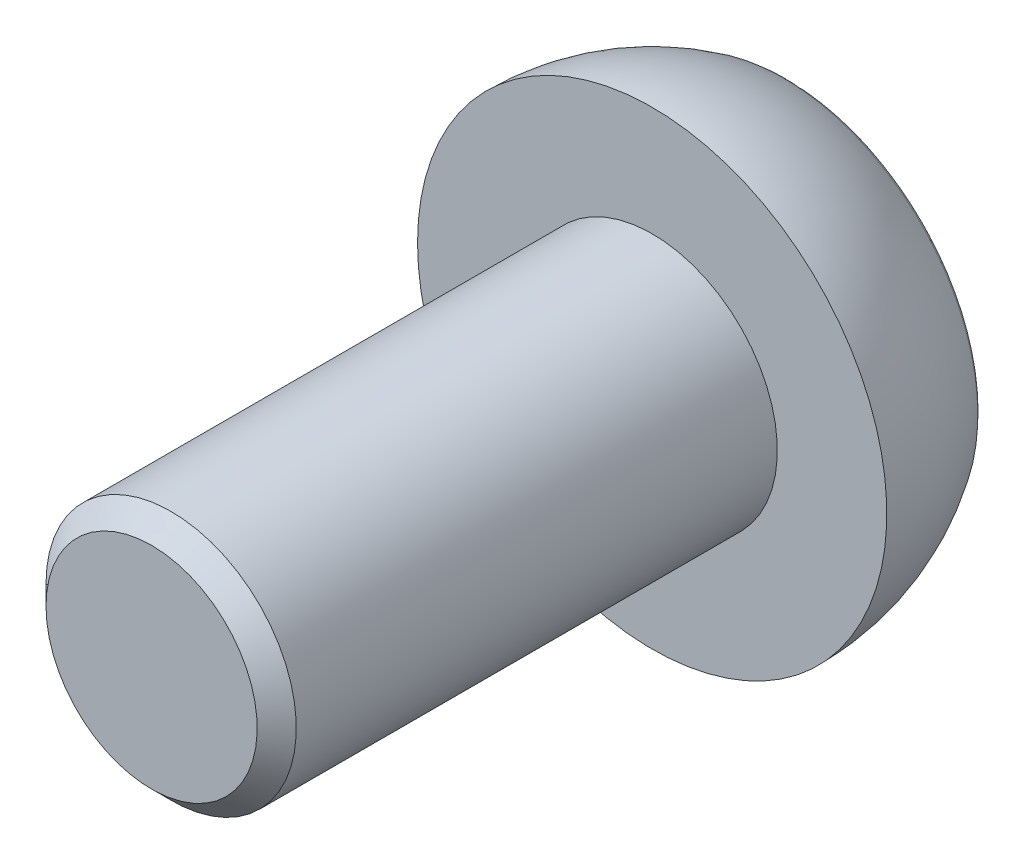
ISO-10303-21;
HEADER;
FILE_DESCRIPTION(('STEP AP214'),'2;1');
FILE_NAME('part.step','',(''),(''),'','','');
FILE_SCHEMA(('AUTOMOTIVE_DESIGN { 1 0 10303 214 1 1 1 1 }'));
ENDSEC;
DATA;
#1=APPLICATION_CONTEXT('core data for automotive mechanical design processes');
#2=APPLICATION_PROTOCOL_DEFINITION('international standard','automotive_design',2000,#1);
#3=PRODUCT_CONTEXT('',#1,'mechanical');
#4=PRODUCT('Part','Part','',(#3));
#5=PRODUCT_RELATED_PRODUCT_CATEGORY('part','',(#4));
#6=PRODUCT_DEFINITION_FORMATION('','',#4);
#7=PRODUCT_DEFINITION_CONTEXT('part definition',#1,'design');
#8=PRODUCT_DEFINITION('design','',#6,#7);
#9=PRODUCT_DEFINITION_SHAPE('','',#8);
#10=(LENGTH_UNIT() NAMED_UNIT(*) SI_UNIT(.MILLI.,.METRE.));
#11=(NAMED_UNIT(*) PLANE_ANGLE_UNIT() SI_UNIT($,.RADIAN.));
#12=(NAMED_UNIT(*) SI_UNIT($,.STERADIAN.) SOLID_ANGLE_UNIT());
#13=UNCERTAINTY_MEASURE_WITH_UNIT(LENGTH_MEASURE(1.E-05),#10,'distance_accuracy_value','');
#14=(GEOMETRIC_REPRESENTATION_CONTEXT(3) GLOBAL_UNCERTAINTY_ASSIGNED_CONTEXT((#13)) GLOBAL_UNIT_ASSIGNED_CONTEXT((#10,
#11,#12)) REPRESENTATION_CONTEXT('',''));
#15=CARTESIAN_POINT('',(0.,0.,0.));
#16=DIRECTION('',(0.,0.,1.));
#17=DIRECTION('',(1.,0.,0.));
#18=AXIS2_PLACEMENT_3D('',#15,#16,#17);
#19=CARTESIAN_POINT('',(65.7291428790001,215.039383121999,-35.5000000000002));
#20=DIRECTION('',(0.,0.,-0.999999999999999));
#21=DIRECTION('',(-0.99997700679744,-0.00678128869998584,0.));
#22=AXIS2_PLACEMENT_3D('',#19,#20,#21);
#23=PLANE('',#22);
#24=DIRECTION('',(-0.494115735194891,-0.869396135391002,0.));
#25=VECTOR('',#24,1.);
#26=CARTESIAN_POINT('',(64.4644896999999,217.195920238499,-35.5000000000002));
#27=LINE('',#26,#25);
#28=CARTESIAN_POINT('',(65.6997790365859,219.36941057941,-35.5000000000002));
#29=VERTEX_POINT('',#28);
#30=CARTESIAN_POINT('',(63.2292003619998,215.022429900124,-35.5000000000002));
#31=VERTEX_POINT('',#30);
#32=EDGE_CURVE('E137',#29,#31,#27,.T.);
#33=ORIENTED_EDGE('',*,*,#32,.T.);
#34=DIRECTION('',(-0.999977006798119,-0.00678128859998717,0.));
#35=VECTOR('',#34,1.);
#36=CARTESIAN_POINT('',(60.7292578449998,215.005476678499,-35.5000000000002));
#37=LINE('',#36,#35);
#38=CARTESIAN_POINT('',(58.229315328,214.988523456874,-35.5000000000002));
#39=VERTEX_POINT('',#38);
#40=EDGE_CURVE('E111',#31,#39,#37,.T.);
#41=ORIENTED_EDGE('',*,*,#40,.T.);
#42=DIRECTION('',(-0.505861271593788,0.862614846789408,0.));
#43=VECTOR('',#42,1.);
#44=CARTESIAN_POINT('',(56.9646621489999,217.145060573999,-35.5000000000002));
#45=LINE('',#44,#43);
#46=CARTESIAN_POINT('',(55.7000089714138,219.301597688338,-35.5000000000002));
#47=VERTEX_POINT('',#46);
#48=EDGE_CURVE('E107',#39,#47,#45,.T.);
#49=ORIENTED_EDGE('',*,*,#48,.T.);
#50=DIRECTION('',(0.49411573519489,0.869396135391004,0.));
#51=VECTOR('',#50,1.);
#52=CARTESIAN_POINT('',(56.9352983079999,221.475088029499,-35.5000000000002));
#53=LINE('',#52,#51);
#54=CARTESIAN_POINT('',(58.1705876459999,223.648578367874,-35.5000000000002));
#55=VERTEX_POINT('',#54);
#56=EDGE_CURVE('E109',#47,#55,#53,.T.);
#57=ORIENTED_EDGE('',*,*,#56,.T.);
#58=DIRECTION('',(0.999977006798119,0.00678128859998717,0.));
#59=VECTOR('',#58,1.);
#60=CARTESIAN_POINT('',(60.670530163,223.665531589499,-35.5000000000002));
#61=LINE('',#60,#59);
#62=CARTESIAN_POINT('',(63.1704726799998,223.682484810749,-35.5000000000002));
#63=VERTEX_POINT('',#62);
#64=EDGE_CURVE('E93',#55,#63,#61,.T.);
#65=ORIENTED_EDGE('',*,*,#64,.T.);
#66=DIRECTION('',(0.505861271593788,-0.862614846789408,0.));
#67=VECTOR('',#66,1.);
#68=CARTESIAN_POINT('',(64.4351258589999,221.525947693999,-35.5000000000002));
#69=LINE('',#68,#67);
#70=EDGE_CURVE('E146',#63,#29,#69,.T.);
#71=ORIENTED_EDGE('',*,*,#70,.T.);
#72=EDGE_LOOP('',(#33,#41,#49,#57,#65,#71));
#73=FACE_BOUND('',#72,.T.);
#74=ADVANCED_FACE('F37',(#73),#23,.T.);
#75=CARTESIAN_POINT('',(60.6998940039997,219.335504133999,-20.2500000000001));
#76=DIRECTION('',(0.,0.,-0.999999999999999));
#77=DIRECTION('',(-1.,0.,0.));
#78=AXIS2_PLACEMENT_3D('',#75,#76,#77);
#79=CYLINDRICAL_SURFACE('',#78,3.99999999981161);
#80=CARTESIAN_POINT('',(60.6998940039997,219.335504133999,-19.6250000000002));
#81=DIRECTION('',(0.,0.,-1.));
#82=DIRECTION('',(-1.,0.,0.));
#83=AXIS2_PLACEMENT_3D('',#80,#81,#82);
#84=CIRCLE('',#83,3.99999999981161);
#85=CARTESIAN_POINT('',(56.6998940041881,219.335504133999,-19.6250000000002));
#86=VERTEX_POINT('',#85);
#87=EDGE_CURVE('E11',#86,#86,#84,.T.);
#88=CARTESIAN_POINT('',(60.6998940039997,219.335504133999,-35.0000000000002));
#89=DIRECTION('',(0.,0.,-0.999999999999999));
#90=DIRECTION('',(-1.,0.,0.));
#91=AXIS2_PLACEMENT_3D('',#88,#89,#90);
#92=CIRCLE('',#91,3.99999999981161);
#93=CARTESIAN_POINT('',(56.6998940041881,219.335504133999,-35.0000000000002));
#94=VERTEX_POINT('',#93);
#95=EDGE_CURVE('E165',#94,#94,#92,.F.);
#96=CARTESIAN_POINT('',(56.6998940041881,219.335504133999,-19.6250000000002));
#97=CARTESIAN_POINT('',(56.6998940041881,219.335504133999,-19.7851562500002));
#98=CARTESIAN_POINT('',(56.6998940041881,219.335504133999,-19.9453125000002));
#99=CARTESIAN_POINT('',(56.6998940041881,219.335504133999,-20.2656250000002));
#100=CARTESIAN_POINT('',(56.6998940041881,219.335504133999,-20.4257812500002));
#101=CARTESIAN_POINT('',(56.6998940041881,219.335504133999,-20.7460937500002));
#102=CARTESIAN_POINT('',(56.6998940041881,219.335504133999,-20.9062500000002));
#103=CARTESIAN_POINT('',(56.6998940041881,219.335504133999,-21.2265625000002));
#104=CARTESIAN_POINT('',(56.6998940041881,219.335504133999,-21.3867187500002));
#105=CARTESIAN_POINT('',(56.6998940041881,219.335504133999,-21.7070312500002));
#106=CARTESIAN_POINT('',(56.6998940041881,219.335504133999,-21.8671875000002));
#107=CARTESIAN_POINT('',(56.6998940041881,219.335504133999,-22.1875000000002));
#108=CARTESIAN_POINT('',(56.6998940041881,219.335504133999,-22.3476562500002));
#109=CARTESIAN_POINT('',(56.6998940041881,219.335504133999,-22.6679687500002));
#110=CARTESIAN_POINT('',(56.6998940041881,219.335504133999,-22.8281250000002));
#111=CARTESIAN_POINT('',(56.6998940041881,219.335504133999,-23.1484375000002));
#112=CARTESIAN_POINT('',(56.6998940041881,219.335504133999,-23.3085937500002));
#113=CARTESIAN_POINT('',(56.6998940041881,219.335504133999,-23.6289062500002));
#114=CARTESIAN_POINT('',(56.6998940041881,219.335504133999,-23.7890625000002));
#115=CARTESIAN_POINT('',(56.6998940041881,219.335504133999,-24.1093750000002));
#116=CARTESIAN_POINT('',(56.6998940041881,219.335504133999,-24.2695312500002));
#117=CARTESIAN_POINT('',(56.6998940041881,219.335504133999,-24.5898437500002));
#118=CARTESIAN_POINT('',(56.6998940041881,219.335504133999,-24.7500000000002));
#119=CARTESIAN_POINT('',(56.6998940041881,219.335504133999,-25.0703125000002));
#120=CARTESIAN_POINT('',(56.6998940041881,219.335504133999,-25.2304687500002));
#121=CARTESIAN_POINT('',(56.6998940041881,219.335504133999,-25.5507812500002));
#122=CARTESIAN_POINT('',(56.6998940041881,219.335504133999,-25.7109375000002));
#123=CARTESIAN_POINT('',(56.6998940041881,219.335504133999,-26.0312500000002));
#124=CARTESIAN_POINT('',(56.6998940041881,219.335504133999,-26.1914062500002));
#125=CARTESIAN_POINT('',(56.6998940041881,219.335504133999,-26.5117187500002));
#126=CARTESIAN_POINT('',(56.6998940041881,219.335504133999,-26.6718750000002));
#127=CARTESIAN_POINT('',(56.6998940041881,219.335504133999,-26.9921875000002));
#128=CARTESIAN_POINT('',(56.6998940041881,219.335504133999,-27.1523437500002));
#129=CARTESIAN_POINT('',(56.6998940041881,219.335504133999,-27.4726562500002));
#130=CARTESIAN_POINT('',(56.6998940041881,219.335504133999,-27.6328125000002));
#131=CARTESIAN_POINT('',(56.6998940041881,219.335504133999,-27.9531250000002));
#132=CARTESIAN_POINT('',(56.6998940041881,219.335504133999,-28.1132812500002));
#133=CARTESIAN_POINT('',(56.6998940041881,219.335504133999,-28.4335937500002));
#134=CARTESIAN_POINT('',(56.6998940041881,219.335504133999,-28.5937500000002));
#135=CARTESIAN_POINT('',(56.6998940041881,219.335504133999,-28.9140625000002));
#136=CARTESIAN_POINT('',(56.6998940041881,219.335504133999,-29.0742187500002));
#137=CARTESIAN_POINT('',(56.6998940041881,219.335504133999,-29.3945312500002));
#138=CARTESIAN_POINT('',(56.6998940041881,219.335504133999,-29.5546875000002));
#139=CARTESIAN_POINT('',(56.6998940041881,219.335504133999,-29.8750000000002));
#140=CARTESIAN_POINT('',(56.6998940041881,219.335504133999,-30.0351562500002));
#141=CARTESIAN_POINT('',(56.6998940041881,219.335504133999,-30.3554687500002));
#142=CARTESIAN_POINT('',(56.6998940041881,219.335504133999,-30.5156250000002));
#143=CARTESIAN_POINT('',(56.6998940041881,219.335504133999,-30.8359375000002));
#144=CARTESIAN_POINT('',(56.6998940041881,219.335504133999,-30.9960937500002));
#145=CARTESIAN_POINT('',(56.6998940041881,219.335504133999,-31.3164062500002));
#146=CARTESIAN_POINT('',(56.6998940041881,219.335504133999,-31.4765625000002));
#147=CARTESIAN_POINT('',(56.6998940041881,219.335504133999,-31.7968750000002));
#148=CARTESIAN_POINT('',(56.6998940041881,219.335504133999,-31.9570312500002));
#149=CARTESIAN_POINT('',(56.6998940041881,219.335504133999,-32.2773437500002));
#150=CARTESIAN_POINT('',(56.6998940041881,219.335504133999,-32.4375000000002));
#151=CARTESIAN_POINT('',(56.6998940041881,219.335504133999,-32.7578125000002));
#152=CARTESIAN_POINT('',(56.6998940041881,219.335504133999,-32.9179687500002));
#153=CARTESIAN_POINT('',(56.6998940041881,219.335504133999,-33.2382812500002));
#154=CARTESIAN_POINT('',(56.6998940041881,219.335504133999,-33.3984375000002));
#155=CARTESIAN_POINT('',(56.6998940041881,219.335504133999,-33.7187500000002));
#156=CARTESIAN_POINT('',(56.6998940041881,219.335504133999,-33.8789062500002));
#157=CARTESIAN_POINT('',(56.6998940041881,219.335504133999,-34.1992187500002));
#158=CARTESIAN_POINT('',(56.6998940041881,219.335504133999,-34.3593750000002));
#159=CARTESIAN_POINT('',(56.6998940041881,219.335504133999,-34.6796875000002));
#160=CARTESIAN_POINT('',(56.6998940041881,219.335504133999,-34.8398437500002));
#161=CARTESIAN_POINT('',(56.6998940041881,219.335504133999,-35.0000000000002));
#162=B_SPLINE_CURVE_WITH_KNOTS('',3,(#96,#97,#98,#99,#100,#101,#102,#103,#104,#105,#106,#107,
#108,#109,#110,#111,#112,#113,#114,#115,#116,#117,#118,#119,#120,#121,#122,#123,#124,#125,#126,
#127,#128,#129,#130,#131,#132,#133,#134,#135,#136,#137,#138,#139,#140,#141,#142,#143,#144,#145,
#146,#147,#148,#149,#150,#151,#152,#153,#154,#155,#156,#157,#158,#159,#160,#161),.UNSPECIFIED.,
.F.,.F.,(4,2,2,2,2,2,2,2,2,2,2,2,2,2,2,2,2,2,2,2,2,2,2,2,2,2,2,2,2,2,2,2,4),(0.,
0.480468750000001,0.960937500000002,1.44140625,1.921875,2.40234375,2.88281250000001,
3.36328125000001,3.84375000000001,4.32421875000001,4.80468750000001,5.28515625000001,
5.76562500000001,6.24609375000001,6.72656250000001,7.20703125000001,7.68750000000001,
8.16796875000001,8.64843750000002,9.12890625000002,9.60937500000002,10.08984375,10.5703125,
11.05078125,11.53125,12.01171875,12.4921875,12.97265625,13.453125,13.93359375,14.4140625,
14.89453125,15.375),.UNSPECIFIED.);
#163=EDGE_CURVE('BSEAM212',#86,#94,#162,.T.);
#164=ORIENTED_EDGE('',*,*,#87,.T.);
#165=ORIENTED_EDGE('',*,*,#95,.T.);
#166=ORIENTED_EDGE('',*,*,#163,.T.);
#167=ORIENTED_EDGE('',*,*,#163,.F.);
#168=EDGE_LOOP('',(#164,#166,#165,#167));
#169=FACE_BOUND('',#168,.T.);
#170=ADVANCED_FACE('F212',(#169),#79,.T.);
#171=CARTESIAN_POINT('',(58.1705876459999,223.648578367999,-39.4000000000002));
#172=DIRECTION('',(-0.869396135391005,0.494115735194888,0.));
#173=DIRECTION('',(-0.49411573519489,-0.869396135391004,0.));
#174=AXIS2_PLACEMENT_3D('',#171,#172,#173);
#175=PLANE('',#174);
#176=DIRECTION('',(0.,0.,0.999999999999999));
#177=VECTOR('',#176,1.);
#178=CARTESIAN_POINT('',(58.1705876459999,223.648578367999,-37.4500000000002));
#179=LINE('',#178,#177);
#180=CARTESIAN_POINT('',(58.1705876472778,223.648578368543,-39.4000000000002));
#181=VERTEX_POINT('',#180);
#182=EDGE_CURVE('E120',#181,#55,#179,.T.);
#183=ORIENTED_EDGE('',*,*,#182,.T.);
#184=ORIENTED_EDGE('',*,*,#56,.F.);
#185=DIRECTION('',(0.,0.,-0.999999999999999));
#186=VECTOR('',#185,1.);
#187=CARTESIAN_POINT('',(55.70000897,219.301597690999,-37.4500000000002));
#188=LINE('',#187,#186);
#189=CARTESIAN_POINT('',(55.7000089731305,219.301597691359,-39.4000000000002));
#190=VERTEX_POINT('',#189);
#191=EDGE_CURVE('E116',#47,#190,#188,.T.);
#192=ORIENTED_EDGE('',*,*,#191,.T.);
#193=DIRECTION('',(-0.494115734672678,-0.869396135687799,0.));
#194=VECTOR('',#193,1.);
#195=CARTESIAN_POINT('',(58.1705876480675,223.648578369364,-39.4000000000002));
#196=LINE('',#195,#194);
#197=EDGE_CURVE('E84',#181,#190,#196,.T.);
#198=ORIENTED_EDGE('',*,*,#197,.F.);
#199=EDGE_LOOP('',(#183,#184,#192,#198));
#200=FACE_BOUND('',#199,.T.);
#201=ADVANCED_FACE('F118',(#200),#175,.F.);
#202=CARTESIAN_POINT('',(55.70000897,219.301597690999,-39.4000000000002));
#203=DIRECTION('',(-0.86261484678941,-0.505861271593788,0.));
#204=DIRECTION('',(0.505861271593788,-0.862614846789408,0.));
#205=AXIS2_PLACEMENT_3D('',#202,#203,#204);
#206=PLANE('',#205);
#207=ORIENTED_EDGE('',*,*,#191,.F.);
#208=ORIENTED_EDGE('',*,*,#48,.F.);
#209=DIRECTION('',(0.,0.,-0.999999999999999));
#210=VECTOR('',#209,1.);
#211=CARTESIAN_POINT('',(58.2293153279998,214.988523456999,-37.4500000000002));
#212=LINE('',#211,#210);
#213=CARTESIAN_POINT('',(58.2293153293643,214.988523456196,-39.4000000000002));
#214=VERTEX_POINT('',#213);
#215=EDGE_CURVE('E131',#39,#214,#212,.T.);
#216=ORIENTED_EDGE('',*,*,#215,.T.);
#217=DIRECTION('',(0.505861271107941,-0.862614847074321,0.));
#218=VECTOR('',#217,1.);
#219=CARTESIAN_POINT('',(55.7000089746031,219.301597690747,-39.4000000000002));
#220=LINE('',#219,#218);
#221=EDGE_CURVE('E125',#190,#214,#220,.T.);
#222=ORIENTED_EDGE('',*,*,#221,.F.);
#223=EDGE_LOOP('',(#207,#208,#216,#222));
#224=FACE_BOUND('',#223,.T.);
#225=ADVANCED_FACE('F123',(#224),#206,.F.);
#226=CARTESIAN_POINT('',(58.2293153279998,214.988523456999,-35.5000000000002));
#227=DIRECTION('',(0.00678128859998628,-0.999977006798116,0.));
#228=DIRECTION('',(0.,0.,-0.999999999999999));
#229=AXIS2_PLACEMENT_3D('',#226,#227,#228);
#230=PLANE('',#229);
#231=ORIENTED_EDGE('',*,*,#215,.F.);
#232=ORIENTED_EDGE('',*,*,#40,.F.);
#233=DIRECTION('',(0.,0.,-0.999999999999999));
#234=VECTOR('',#233,1.);
#235=CARTESIAN_POINT('',(63.229200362,215.022429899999,-37.4500000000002));
#236=LINE('',#235,#234);
#237=CARTESIAN_POINT('',(63.2292003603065,215.022429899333,-39.4000000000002));
#238=VERTEX_POINT('',#237);
#239=EDGE_CURVE('E143',#31,#238,#236,.T.);
#240=ORIENTED_EDGE('',*,*,#239,.T.);
#241=DIRECTION('',(0.999977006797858,0.00678128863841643,0.));
#242=VECTOR('',#241,1.);
#243=CARTESIAN_POINT('',(60.7292578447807,215.005476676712,-39.4000000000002));
#244=LINE('',#243,#242);
#245=EDGE_CURVE('E138',#214,#238,#244,.T.);
#246=ORIENTED_EDGE('',*,*,#245,.F.);
#247=EDGE_LOOP('',(#231,#232,#240,#246));
#248=FACE_BOUND('',#247,.T.);
#249=ADVANCED_FACE('F241',(#248),#230,.F.);
#250=CARTESIAN_POINT('',(63.229200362,215.022429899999,-39.4000000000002));
#251=DIRECTION('',(0.869396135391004,-0.494115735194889,0.));
#252=DIRECTION('',(0.494115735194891,0.869396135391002,0.));
#253=AXIS2_PLACEMENT_3D('',#250,#251,#252);
#254=PLANE('',#253);
#255=ORIENTED_EDGE('',*,*,#239,.F.);
#256=ORIENTED_EDGE('',*,*,#32,.F.);
#257=DIRECTION('',(0.,0.,-0.999999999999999));
#258=VECTOR('',#257,1.);
#259=CARTESIAN_POINT('',(65.6997790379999,219.369410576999,-37.4500000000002));
#260=LINE('',#259,#258);
#261=CARTESIAN_POINT('',(65.6997790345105,219.369410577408,-39.4000000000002));
#262=VERTEX_POINT('',#261);
#263=EDGE_CURVE('E234',#29,#262,#260,.T.);
#264=ORIENTED_EDGE('',*,*,#263,.T.);
#265=DIRECTION('',(0.494115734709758,0.869396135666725,0.));
#266=VECTOR('',#265,1.);
#267=CARTESIAN_POINT('',(63.2292003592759,215.022429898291,-39.4000000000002));
#268=LINE('',#267,#266);
#269=EDGE_CURVE('E142',#238,#262,#268,.T.);
#270=ORIENTED_EDGE('',*,*,#269,.F.);
#271=EDGE_LOOP('',(#255,#256,#264,#270));
#272=FACE_BOUND('',#271,.T.);
#273=ADVANCED_FACE('F244',(#272),#254,.F.);
#274=CARTESIAN_POINT('',(65.6997790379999,219.369410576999,-39.4000000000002));
#275=DIRECTION('',(0.86261484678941,0.505861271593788,0.));
#276=DIRECTION('',(-0.505861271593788,0.862614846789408,0.));
#277=AXIS2_PLACEMENT_3D('',#274,#275,#276);
#278=PLANE('',#277);
#279=ORIENTED_EDGE('',*,*,#263,.F.);
#280=ORIENTED_EDGE('',*,*,#70,.F.);
#281=DIRECTION('',(0.,0.,-0.999999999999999));
#282=VECTOR('',#281,1.);
#283=CARTESIAN_POINT('',(63.1704726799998,223.682484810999,-37.4500000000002));
#284=LINE('',#283,#282);
#285=CARTESIAN_POINT('',(63.1704726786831,223.682484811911,-39.4000000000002));
#286=VERTEX_POINT('',#285);
#287=EDGE_CURVE('E232',#63,#286,#284,.T.);
#288=ORIENTED_EDGE('',*,*,#287,.T.);
#289=DIRECTION('',(-0.505861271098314,0.862614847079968,0.));
#290=VECTOR('',#289,1.);
#291=CARTESIAN_POINT('',(65.6997790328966,219.369410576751,-39.4000000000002));
#292=LINE('',#291,#290);
#293=EDGE_CURVE('E152',#262,#286,#292,.T.);
#294=ORIENTED_EDGE('',*,*,#293,.F.);
#295=EDGE_LOOP('',(#279,#280,#288,#294));
#296=FACE_BOUND('',#295,.T.);
#297=ADVANCED_FACE('F323',(#296),#278,.F.);
#298=CARTESIAN_POINT('',(58.1705876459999,223.648578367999,-39.4000000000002));
#299=DIRECTION('',(-0.00678128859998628,0.999977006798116,0.));
#300=DIRECTION('',(0.,0.,0.999999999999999));
#301=AXIS2_PLACEMENT_3D('',#298,#299,#300);
#302=PLANE('',#301);
#303=ORIENTED_EDGE('',*,*,#287,.F.);
#304=ORIENTED_EDGE('',*,*,#64,.F.);
#305=ORIENTED_EDGE('',*,*,#182,.F.);
#306=DIRECTION('',(-0.999977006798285,-0.00678128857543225,0.));
#307=VECTOR('',#306,1.);
#308=CARTESIAN_POINT('',(60.6705301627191,223.665531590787,-39.4000000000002));
#309=LINE('',#308,#307);
#310=EDGE_CURVE('E156',#286,#181,#309,.T.);
#311=ORIENTED_EDGE('',*,*,#310,.F.);
#312=EDGE_LOOP('',(#303,#304,#305,#311));
#313=FACE_BOUND('',#312,.T.);
#314=ADVANCED_FACE('F211',(#313),#302,.F.);
#315=CARTESIAN_POINT('',(60.7393130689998,213.522721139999,-39.4000000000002));
#316=CARTESIAN_POINT('',(49.1137470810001,213.443883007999,-39.4000000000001));
#317=CARTESIAN_POINT('',(49.0349089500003,225.069448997,-39.4000000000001));
#318=CARTESIAN_POINT('',(60.6604749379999,225.148287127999,-39.4000000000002));
#319=CARTESIAN_POINT('',(60.7404672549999,213.35252351,-39.4000000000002));
#320=CARTESIAN_POINT('',(48.7745060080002,213.271377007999,-39.4));
#321=CARTESIAN_POINT('',(48.6933595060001,225.237338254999,-39.4));
#322=CARTESIAN_POINT('',(60.659320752,225.318484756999,-39.4000000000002));
#323=CARTESIAN_POINT('',(60.7414856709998,213.202346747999,-39.3199096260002));
#324=CARTESIAN_POINT('',(48.4751708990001,213.119163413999,-39.319909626));
#325=CARTESIAN_POINT('',(48.3919875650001,225.385478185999,-39.319909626));
#326=CARTESIAN_POINT('',(60.658302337,225.468661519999,-39.3199096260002));
#327=CARTESIAN_POINT('',(60.742128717,213.107522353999,-39.1785714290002));
#328=CARTESIAN_POINT('',(48.2861651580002,213.023052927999,-39.178571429));
#329=CARTESIAN_POINT('',(48.201695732,225.479016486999,-39.1785714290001));
#330=CARTESIAN_POINT('',(60.6576592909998,225.563485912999,-39.1785714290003));
#331=(BOUNDED_SURFACE() B_SPLINE_SURFACE(3,3,((#315,#316,#317,#318),(#319,#320,#321,#322),(#323,
#324,#325,#326),(#327,#328,#329,#330)),.UNSPECIFIED.,.F.,.F.,
.F.) B_SPLINE_SURFACE_WITH_KNOTS((4,4),(4,4),(0.,1.),(0.,1.),
.UNSPECIFIED.) GEOMETRIC_REPRESENTATION_ITEM() RATIONAL_B_SPLINE_SURFACE(((1.,0.333333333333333,
0.333333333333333,1.),(0.921577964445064,0.307192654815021,0.307192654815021,0.921577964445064),
(0.921577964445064,0.307192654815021,0.307192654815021,0.921577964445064),(1.,0.333333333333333,
0.333333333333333,1.))) REPRESENTATION_ITEM('') SURFACE());
#332=CARTESIAN_POINT('',(60.6604749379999,225.148287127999,-39.4000000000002));
#333=CARTESIAN_POINT('',(60.659320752,225.318484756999,-39.4000000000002));
#334=CARTESIAN_POINT('',(60.658302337,225.468661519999,-39.3199096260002));
#335=CARTESIAN_POINT('',(60.6576592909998,225.563485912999,-39.1785714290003));
#336=(BOUNDED_CURVE() B_SPLINE_CURVE(3,(#332,#333,#334,#335),.UNSPECIFIED.,.F.,
.F.) B_SPLINE_CURVE_WITH_KNOTS((4,4),(0.,1.),
.UNSPECIFIED.) CURVE() GEOMETRIC_REPRESENTATION_ITEM() RATIONAL_B_SPLINE_CURVE((1.,
0.921577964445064,0.921577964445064,1.)) REPRESENTATION_ITEM(''));
#337=CARTESIAN_POINT('',(60.6576592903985,225.563485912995,-39.1785714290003));
#338=VERTEX_POINT('',#337);
#339=CARTESIAN_POINT('',(60.660474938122,225.148287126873,-39.4000000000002));
#340=VERTEX_POINT('',#339);
#341=EDGE_CURVE('E168',#338,#340,#336,.F.);
#342=CARTESIAN_POINT('',(60.6604749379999,225.148287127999,-39.4000000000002));
#343=CARTESIAN_POINT('',(49.0349089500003,225.069448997,-39.4000000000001));
#344=CARTESIAN_POINT('',(49.1137470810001,213.443883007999,-39.4000000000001));
#345=CARTESIAN_POINT('',(60.7393130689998,213.522721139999,-39.4000000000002));
#346=(BOUNDED_CURVE() B_SPLINE_CURVE(3,(#342,#343,#344,#345),.UNSPECIFIED.,.F.,
.F.) B_SPLINE_CURVE_WITH_KNOTS((4,4),(0.,1.),
.UNSPECIFIED.) CURVE() GEOMETRIC_REPRESENTATION_ITEM() RATIONAL_B_SPLINE_CURVE((1.,
0.333333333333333,0.333333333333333,1.)) REPRESENTATION_ITEM(''));
#347=CARTESIAN_POINT('',(60.7393130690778,213.522721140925,-39.4000000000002));
#348=VERTEX_POINT('',#347);
#349=EDGE_CURVE('E164',#348,#340,#346,.F.);
#350=CARTESIAN_POINT('',(60.7393130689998,213.522721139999,-39.4000000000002));
#351=CARTESIAN_POINT('',(60.7404672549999,213.35252351,-39.4000000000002));
#352=CARTESIAN_POINT('',(60.7414856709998,213.202346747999,-39.3199096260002));
#353=CARTESIAN_POINT('',(60.742128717,213.107522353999,-39.1785714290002));
#354=(BOUNDED_CURVE() B_SPLINE_CURVE(3,(#350,#351,#352,#353),.UNSPECIFIED.,.F.,
.F.) B_SPLINE_CURVE_WITH_KNOTS((4,4),(0.,1.),
.UNSPECIFIED.) CURVE() GEOMETRIC_REPRESENTATION_ITEM() RATIONAL_B_SPLINE_CURVE((1.,
0.921577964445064,0.921577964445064,1.)) REPRESENTATION_ITEM(''));
#355=CARTESIAN_POINT('',(60.7421287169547,213.107522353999,-39.1785714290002));
#356=VERTEX_POINT('',#355);
#357=EDGE_CURVE('E260',#348,#356,#354,.T.);
#358=CARTESIAN_POINT('',(60.6998940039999,219.335504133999,-39.178571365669));
#359=DIRECTION('',(0.,0.,-0.999999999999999));
#360=DIRECTION('',(0.999977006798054,0.00678128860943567,0.));
#361=AXIS2_PLACEMENT_3D('',#358,#359,#360);
#362=CIRCLE('',#361,6.22812502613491);
#363=EDGE_CURVE('E151',#356,#338,#362,.T.);
#364=ORIENTED_EDGE('',*,*,#341,.T.);
#365=ORIENTED_EDGE('',*,*,#349,.F.);
#366=ORIENTED_EDGE('',*,*,#357,.T.);
#367=ORIENTED_EDGE('',*,*,#363,.T.);
#368=EDGE_LOOP('',(#364,#365,#366,#367));
#369=FACE_BOUND('',#368,.T.);
#370=ADVANCED_FACE('F198',(#369),#331,.T.);
#371=CARTESIAN_POINT('',(68.3411894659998,211.797148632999,-35.0000000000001));
#372=DIRECTION('',(0.,0.,-0.999999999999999));
#373=DIRECTION('',(-0.999977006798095,-0.00678128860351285,0.));
#374=AXIS2_PLACEMENT_3D('',#371,#372,#373);
#375=PLANE('',#374);
#376=ORIENTED_EDGE('',*,*,#95,.F.);
#377=EDGE_LOOP('',(#376));
#378=FACE_BOUND('',#377,.T.);
#379=CARTESIAN_POINT('',(60.6998940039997,219.335504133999,-35.0000000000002));
#380=DIRECTION('',(0.,0.,-0.999999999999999));
#381=DIRECTION('',(-1.,0.,0.));
#382=AXIS2_PLACEMENT_3D('',#379,#380,#381);
#383=CIRCLE('',#382,7.50000000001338);
#384=CARTESIAN_POINT('',(53.1998940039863,219.335504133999,-35.0000000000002));
#385=VERTEX_POINT('',#384);
#386=EDGE_CURVE('E147',#385,#385,#383,.F.);
#387=ORIENTED_EDGE('',*,*,#386,.T.);
#388=EDGE_LOOP('',(#387));
#389=FACE_BOUND('',#388,.T.);
#390=ADVANCED_FACE('F210',(#378,#389),#375,.F.);
#391=CARTESIAN_POINT('',(54.8572497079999,213.413075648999,-39.4000000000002));
#392=DIRECTION('',(0.,0.,-0.999999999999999));
#393=DIRECTION('',(-0.0067812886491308,0.999977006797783,0.));
#394=AXIS2_PLACEMENT_3D('',#391,#392,#393);
#395=PLANE('',#394);
#396=ORIENTED_EDGE('',*,*,#293,.T.);
#397=ORIENTED_EDGE('',*,*,#310,.T.);
#398=ORIENTED_EDGE('',*,*,#197,.T.);
#399=ORIENTED_EDGE('',*,*,#221,.T.);
#400=ORIENTED_EDGE('',*,*,#245,.T.);
#401=ORIENTED_EDGE('',*,*,#269,.T.);
#402=EDGE_LOOP('',(#396,#397,#398,#399,#400,#401));
#403=FACE_BOUND('',#402,.T.);
#404=CARTESIAN_POINT('',(60.7393130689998,213.522721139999,-39.4000000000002));
#405=CARTESIAN_POINT('',(60.8008187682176,213.523137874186,-39.4000000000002));
#406=CARTESIAN_POINT('',(60.8623179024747,213.524531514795,-39.4000000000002));
#407=CARTESIAN_POINT('',(60.9871907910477,213.529344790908,-39.4000000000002));
#408=CARTESIAN_POINT('',(61.0505621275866,213.532827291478,-39.4000000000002));
#409=CARTESIAN_POINT('',(61.179161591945,213.542008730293,-39.4000000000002));
#410=CARTESIAN_POINT('',(61.2443849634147,213.547774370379,-39.4000000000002));
#411=CARTESIAN_POINT('',(61.3766560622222,213.561722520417,-39.4000000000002));
#412=CARTESIAN_POINT('',(61.4436963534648,213.569975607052,-39.4000000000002));
#413=CARTESIAN_POINT('',(61.5795521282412,213.589109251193,-39.4000000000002));
#414=CARTESIAN_POINT('',(61.6483571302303,213.600064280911,-39.4000000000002));
#415=CARTESIAN_POINT('',(61.7876742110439,213.624821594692,-39.4000000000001));
#416=CARTESIAN_POINT('',(61.8581723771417,213.638702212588,-39.4000000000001));
#417=CARTESIAN_POINT('',(62.0007863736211,213.669538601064,-39.4000000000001));
#418=CARTESIAN_POINT('',(62.0728844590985,213.686576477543,-39.4000000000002));
#419=CARTESIAN_POINT('',(62.2185851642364,213.723961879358,-39.4000000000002));
#420=CARTESIAN_POINT('',(62.2921657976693,213.744395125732,-39.4000000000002));
#421=CARTESIAN_POINT('',(62.44069229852,213.78881043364,-39.4000000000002));
#422=CARTESIAN_POINT('',(62.5156115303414,213.812881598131,-39.4000000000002));
#423=CARTESIAN_POINT('',(62.6666473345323,213.864814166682,-39.4000000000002));
#424=CARTESIAN_POINT('',(62.742732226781,213.892767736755,-39.4000000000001));
#425=CARTESIAN_POINT('',(62.8959005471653,213.95270586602,-39.4000000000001));
#426=CARTESIAN_POINT('',(62.9729468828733,213.984785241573,-39.4000000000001));
#427=CARTESIAN_POINT('',(63.1278062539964,214.053211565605,-39.4000000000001));
#428=CARTESIAN_POINT('',(63.2055764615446,214.089655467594,-39.4000000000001));
#429=CARTESIAN_POINT('',(63.3616168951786,214.16703919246,-39.4000000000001));
#430=CARTESIAN_POINT('',(63.4398382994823,214.208077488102,-39.4000000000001));
#431=CARTESIAN_POINT('',(63.5964782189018,214.294865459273,-39.4000000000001));
#432=CARTESIAN_POINT('',(63.6748417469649,214.340714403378,-39.4000000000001));
#433=CARTESIAN_POINT('',(63.8314259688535,214.437321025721,-39.4000000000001));
#434=CARTESIAN_POINT('',(63.9095854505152,214.488177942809,-39.4000000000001));
#435=CARTESIAN_POINT('',(64.0653845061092,214.594974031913,-39.4000000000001));
#436=CARTESIAN_POINT('',(64.1429567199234,214.651011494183,-39.4000000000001));
#437=CARTESIAN_POINT('',(64.2971678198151,214.768312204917,-39.4000000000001));
#438=CARTESIAN_POINT('',(64.3737334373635,214.829671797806,-39.4000000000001));
#439=CARTESIAN_POINT('',(64.5254833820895,214.95772385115,-39.4000000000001));
#440=CARTESIAN_POINT('',(64.6005889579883,215.024509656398,-39.4000000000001));
#441=CARTESIAN_POINT('',(64.748939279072,215.163478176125,-39.4000000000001));
#442=CARTESIAN_POINT('',(64.8221004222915,215.235750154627,-39.4000000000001));
#443=CARTESIAN_POINT('',(64.9660549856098,215.385705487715,-39.4000000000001));
#444=CARTESIAN_POINT('',(65.0367608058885,215.463472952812,-39.4000000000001));
#445=CARTESIAN_POINT('',(65.1752760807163,215.624378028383,-39.4000000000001));
#446=CARTESIAN_POINT('',(65.2429950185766,215.707593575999,-39.4000000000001));
#447=CARTESIAN_POINT('',(65.3749929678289,215.879292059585,-39.4000000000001));
#448=CARTESIAN_POINT('',(65.4391798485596,215.967845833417,-39.4000000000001));
#449=CARTESIAN_POINT('',(65.563563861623,216.150052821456,-39.4000000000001));
#450=CARTESIAN_POINT('',(65.6236687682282,216.243769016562,-39.4000000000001));
#451=CARTESIAN_POINT('',(65.7393406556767,216.436060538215,-39.4000000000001));
#452=CARTESIAN_POINT('',(65.7948169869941,216.534690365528,-39.4000000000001));
#453=CARTESIAN_POINT('',(65.9007015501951,216.736509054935,-39.4000000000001));
#454=CARTESIAN_POINT('',(65.9510226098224,216.839743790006,-39.4000000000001));
#455=CARTESIAN_POINT('',(66.0220853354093,216.997205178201,-39.4000000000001));
#456=CARTESIAN_POINT('',(66.0451403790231,217.050399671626,-39.4000000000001));
#457=CARTESIAN_POINT('',(66.0897858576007,217.157783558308,-39.4000000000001));
#458=CARTESIAN_POINT('',(66.1113664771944,217.21197704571,-39.4000000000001));
#459=CARTESIAN_POINT('',(66.1530044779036,217.321297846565,-39.4000000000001));
#460=CARTESIAN_POINT('',(66.1730525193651,217.376428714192,-39.4000000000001));
#461=CARTESIAN_POINT('',(66.2115712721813,217.487561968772,-39.4000000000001));
#462=CARTESIAN_POINT('',(66.2300331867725,217.543567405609,-39.4000000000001));
#463=CARTESIAN_POINT('',(66.2653285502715,217.656382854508,-39.4000000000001));
#464=CARTESIAN_POINT('',(66.282153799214,217.71319543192,-39.4000000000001));
#465=CARTESIAN_POINT('',(66.3141285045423,217.827554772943,-39.4000000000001));
#466=CARTESIAN_POINT('',(66.3292704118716,217.885103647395,-39.4000000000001));
#467=CARTESIAN_POINT('',(66.3578350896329,218.000861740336,-39.4000000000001));
#468=CARTESIAN_POINT('',(66.3712510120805,218.059072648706,-39.4000000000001));
#469=CARTESIAN_POINT('',(66.3963246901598,218.17607787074,-39.4000000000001));
#470=CARTESIAN_POINT('',(66.4079763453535,218.234873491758,-39.4000000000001));
#471=CARTESIAN_POINT('',(66.4294870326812,218.352968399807,-39.4000000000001));
#472=CARTESIAN_POINT('',(66.4393407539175,218.412268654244,-39.4000000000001));
#473=CARTESIAN_POINT('',(66.457225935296,218.53129063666,-39.4000000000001));
#474=CARTESIAN_POINT('',(66.4652529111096,218.591013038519,-39.4000000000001));
#475=CARTESIAN_POINT('',(66.4794599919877,218.710795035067,-39.4000000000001));
#476=CARTESIAN_POINT('',(66.4856364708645,218.770855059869,-39.4000000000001));
#477=CARTESIAN_POINT('',(66.4961231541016,218.891226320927,-39.4000000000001));
#478=CARTESIAN_POINT('',(66.5004306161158,218.951537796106,-39.4000000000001));
#479=CARTESIAN_POINT('',(66.5071652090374,219.072324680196,-39.4000000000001));
#480=CARTESIAN_POINT('',(66.5095905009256,219.132800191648,-39.4000000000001));
#481=CARTESIAN_POINT('',(66.5125521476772,219.253826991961,-39.4000000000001));
#482=CARTESIAN_POINT('',(66.513087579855,219.314378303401,-39.4000000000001));
#483=CARTESIAN_POINT('',(66.5122664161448,219.435468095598,-39.4000000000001));
#484=CARTESIAN_POINT('',(66.5109098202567,219.496006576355,-39.4000000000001));
#485=CARTESIAN_POINT('',(66.5063070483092,219.616982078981,-39.4000000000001));
#486=CARTESIAN_POINT('',(66.503061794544,219.677419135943,-39.4000000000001));
#487=CARTESIAN_POINT('',(66.4946896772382,219.798103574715,-39.4000000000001));
#488=CARTESIAN_POINT('',(66.489564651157,219.858351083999,-39.4000000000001));
#489=CARTESIAN_POINT('',(66.477446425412,219.978569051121,-39.4000000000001));
#490=CARTESIAN_POINT('',(66.4704559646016,220.038539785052,-39.4000000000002));
#491=CARTESIAN_POINT('',(66.4546256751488,220.158118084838,-39.4000000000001));
#492=CARTESIAN_POINT('',(66.445789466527,220.217726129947,-39.4000000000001));
#493=CARTESIAN_POINT('',(66.4262917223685,220.336494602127,-39.4000000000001));
#494=CARTESIAN_POINT('',(66.4156346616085,220.395655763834,-39.4000000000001));
#495=CARTESIAN_POINT('',(66.3925243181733,220.513448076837,-39.4000000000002));
#496=CARTESIAN_POINT('',(66.3800763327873,220.572080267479,-39.4000000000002));
#497=CARTESIAN_POINT('',(66.3534181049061,220.688734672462,-39.4000000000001));
#498=CARTESIAN_POINT('',(66.339213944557,220.746758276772,-39.4000000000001));
#499=CARTESIAN_POINT('',(66.3090819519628,220.862118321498,-39.4000000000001));
#500=CARTESIAN_POINT('',(66.2931609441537,220.919456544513,-39.4000000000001));
#501=CARTESIAN_POINT('',(66.2596382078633,221.033371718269,-39.4000000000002));
#502=CARTESIAN_POINT('',(66.2420439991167,221.089950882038,-39.4000000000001));
#503=CARTESIAN_POINT('',(66.2052218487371,221.202277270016,-39.4000000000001));
#504=CARTESIAN_POINT('',(66.1860020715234,221.25802717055,-39.4000000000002));
#505=CARTESIAN_POINT('',(66.1459796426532,221.368627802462,-39.4000000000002));
#506=CARTESIAN_POINT('',(66.1251857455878,221.423481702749,-39.4000000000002));
#507=CARTESIAN_POINT('',(66.0820689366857,221.532227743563,-39.4000000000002));
#508=CARTESIAN_POINT('',(66.0597553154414,221.586123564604,-39.4000000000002));
#509=CARTESIAN_POINT('',(66.0136575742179,221.692892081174,-39.4000000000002));
#510=CARTESIAN_POINT('',(65.9898832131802,221.745769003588,-39.4000000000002));
#511=CARTESIAN_POINT('',(65.9166914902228,221.902252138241,-39.4000000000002));
#512=CARTESIAN_POINT('',(65.8649749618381,222.004794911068,-39.4000000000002));
#513=CARTESIAN_POINT('',(65.7563630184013,222.205159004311,-39.4000000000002));
#514=CARTESIAN_POINT('',(65.6995541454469,222.303027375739,-39.4000000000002));
#515=CARTESIAN_POINT('',(65.5812849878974,222.493732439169,-39.4000000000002));
#516=CARTESIAN_POINT('',(65.5199146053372,222.586624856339,-39.4000000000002));
#517=CARTESIAN_POINT('',(65.3930708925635,222.767128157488,-39.4000000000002));
#518=CARTESIAN_POINT('',(65.3276889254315,222.854803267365,-39.4000000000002));
#519=CARTESIAN_POINT('',(65.1933744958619,223.024695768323,-39.4000000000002));
#520=CARTESIAN_POINT('',(65.1245331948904,223.106985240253,-39.4000000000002));
#521=CARTESIAN_POINT('',(64.9838484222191,223.265996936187,-39.4000000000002));
#522=CARTESIAN_POINT('',(64.9120944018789,223.342798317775,-39.4000000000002));
#523=CARTESIAN_POINT('',(64.7661193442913,223.490787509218,-39.4000000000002));
#524=CARTESIAN_POINT('',(64.6919847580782,223.5620606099,-39.4000000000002));
#525=CARTESIAN_POINT('',(64.5417633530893,223.699004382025,-39.4000000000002));
#526=CARTESIAN_POINT('',(64.4657589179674,223.764765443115,-39.4000000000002));
#527=CARTESIAN_POINT('',(64.3122862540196,223.890747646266,-39.4000000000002));
#528=CARTESIAN_POINT('',(64.2348955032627,223.951063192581,-39.4000000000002));
#529=CARTESIAN_POINT('',(64.0791077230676,224.066261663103,-39.4000000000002));
#530=CARTESIAN_POINT('',(64.0007826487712,224.12124191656,-39.4000000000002));
#531=CARTESIAN_POINT('',(63.8435495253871,224.225915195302,-39.4000000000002));
#532=CARTESIAN_POINT('',(63.7647074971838,224.275707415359,-39.4000000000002));
#533=CARTESIAN_POINT('',(63.6068274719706,224.37018151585,-39.4000000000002));
#534=CARTESIAN_POINT('',(63.527849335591,224.414963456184,-39.4000000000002));
#535=CARTESIAN_POINT('',(63.3700467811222,224.499619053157,-39.4000000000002));
#536=CARTESIAN_POINT('',(63.2912759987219,224.539592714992,-39.4000000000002));
#537=CARTESIAN_POINT('',(63.134200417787,224.61485306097,-39.4000000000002));
#538=CARTESIAN_POINT('',(63.0559431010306,224.650238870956,-39.4000000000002));
#539=CARTESIAN_POINT('',(62.9001699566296,224.716558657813,-39.4000000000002));
#540=CARTESIAN_POINT('',(62.8226956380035,224.747590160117,-39.4000000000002));
#541=CARTESIAN_POINT('',(62.6687285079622,224.805445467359,-39.4000000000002));
#542=CARTESIAN_POINT('',(62.5922714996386,224.832364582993,-39.4000000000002));
#543=CARTESIAN_POINT('',(62.4405452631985,224.882243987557,-39.4000000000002));
#544=CARTESIAN_POINT('',(62.3653064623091,224.905296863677,-39.4000000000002));
#545=CARTESIAN_POINT('',(62.2161912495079,224.947693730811,-39.4000000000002));
#546=CARTESIAN_POINT('',(62.1423402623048,224.967127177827,-39.4000000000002));
#547=CARTESIAN_POINT('',(61.9961459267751,225.002533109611,-39.4000000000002));
#548=CARTESIAN_POINT('',(61.9238234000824,225.018591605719,-39.4000000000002));
#549=CARTESIAN_POINT('',(61.7808043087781,225.04749098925,-39.4000000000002));
#550=CARTESIAN_POINT('',(61.7101243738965,225.060414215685,-39.4000000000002));
#551=CARTESIAN_POINT('',(61.5704843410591,225.083279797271,-39.4000000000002));
#552=CARTESIAN_POINT('',(61.5015370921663,225.093300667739,-39.4000000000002));
#553=CARTESIAN_POINT('',(61.3654343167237,225.110590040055,-39.4000000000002));
#554=CARTESIAN_POINT('',(61.2982882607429,225.117933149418,-39.4000000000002));
#555=CARTESIAN_POINT('',(61.1658401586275,225.130086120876,-39.4000000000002));
#556=CARTESIAN_POINT('',(61.1005445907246,225.134966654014,-39.4000000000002));
#557=CARTESIAN_POINT('',(60.9718324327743,225.142403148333,-39.4000000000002));
#558=CARTESIAN_POINT('',(60.9084196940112,225.145025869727,-39.4000000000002));
#559=CARTESIAN_POINT('',(60.7834930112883,225.148145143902,-39.4000000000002));
#560=CARTESIAN_POINT('',(60.7219806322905,225.148704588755,-39.4000000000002));
#561=CARTESIAN_POINT('',(60.6604749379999,225.148287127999,-39.4000000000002));
#562=B_SPLINE_CURVE_WITH_KNOTS('',3,(#404,#405,#406,#407,#408,#409,#410,#411,#412,#413,#414,
#415,#416,#417,#418,#419,#420,#421,#422,#423,#424,#425,#426,#427,#428,#429,#430,#431,#432,#433,
#434,#435,#436,#437,#438,#439,#440,#441,#442,#443,#444,#445,#446,#447,#448,#449,#450,#451,#452,
#453,#454,#455,#456,#457,#458,#459,#460,#461,#462,#463,#464,#465,#466,#467,#468,#469,#470,#471,
#472,#473,#474,#475,#476,#477,#478,#479,#480,#481,#482,#483,#484,#485,#486,#487,#488,#489,#490,
#491,#492,#493,#494,#495,#496,#497,#498,#499,#500,#501,#502,#503,#504,#505,#506,#507,#508,#509,
#510,#511,#512,#513,#514,#515,#516,#517,#518,#519,#520,#521,#522,#523,#524,#525,#526,#527,#528,
#529,#530,#531,#532,#533,#534,#535,#536,#537,#538,#539,#540,#541,#542,#543,#544,#545,#546,#547,
#548,#549,#550,#551,#552,#553,#554,#555,#556,#557,#558,#559,#560,#561),.UNSPECIFIED.,.F.,.F.,(4,
2,2,2,2,2,2,2,2,2,2,2,2,2,2,2,2,2,2,2,2,2,2,2,2,2,2,2,2,2,2,2,2,2,2,2,2,2,2,2,2,2,2,2,2,2,2,2,2,
2,2,2,2,2,2,2,2,2,2,2,2,2,2,2,2,2,2,2,2,2,2,2,2,2,2,2,2,2,4),(0.,0.184513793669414,
0.374880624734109,0.571276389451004,0.773874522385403,0.982844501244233,1.19835014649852,
1.42054770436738,1.64958370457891,1.88559258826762,2.12869410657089,2.37899049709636,
2.63656345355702,2.90147091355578,3.17374370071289,3.45338206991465,3.74035221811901,
4.03458283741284,4.33596180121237,4.64433308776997,4.95949405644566,5.28119320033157,
5.60912850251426,5.9429465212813,6.282242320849,6.62656034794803,6.80046639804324,
6.97543560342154,7.15139778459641,7.32828014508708,7.50600742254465,7.68450205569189,
7.86368436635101,8.04347275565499,8.22378391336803,8.40453303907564,8.58563407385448,
8.76699994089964,8.94854279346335,9.13017426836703,9.31180574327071,9.49334859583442,
9.6747144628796,9.85581549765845,10.0365646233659,10.2168757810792,10.3966641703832,
10.5758464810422,10.7543411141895,10.9320683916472,11.108950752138,11.2849129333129,
11.4598821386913,11.6337881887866,11.9781062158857,12.3174020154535,12.6512200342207,
12.9791553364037,13.3008544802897,13.6160154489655,13.9243867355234,14.225765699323,
14.519996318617,14.8069664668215,15.0866048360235,15.3588776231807,15.6237850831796,
15.8813580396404,16.1316544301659,16.3747559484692,16.6107648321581,16.8398008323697,
17.0619983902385,17.2775040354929,17.4864740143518,17.6890721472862,17.8854679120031,
18.0758347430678,18.2603485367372),.UNSPECIFIED.);
#563=EDGE_CURVE('E170',#348,#340,#562,.T.);
#564=ORIENTED_EDGE('',*,*,#563,.F.);
#565=ORIENTED_EDGE('',*,*,#349,.T.);
#566=EDGE_LOOP('',(#564,#565));
#567=FACE_BOUND('',#566,.T.);
#568=ADVANCED_FACE('F39',(#403,#567),#395,.T.);
#569=CARTESIAN_POINT('',(60.6998940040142,219.335504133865,-34.9999999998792));
#570=DIRECTION('',(0.,0.,-0.999999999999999));
#571=DIRECTION('',(-0.999977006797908,-0.00678128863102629,0.));
#572=AXIS2_PLACEMENT_3D('',#569,#570,#571);
#573=SPHERICAL_SURFACE('',#572,7.5);
#574=ORIENTED_EDGE('',*,*,#386,.F.);
#575=EDGE_LOOP('',(#574));
#576=FACE_BOUND('',#575,.T.);
#577=CARTESIAN_POINT('',(60.6998940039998,219.335504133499,-39.1785714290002));
#578=DIRECTION('',(0.,0.,-0.999999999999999));
#579=DIRECTION('',(-1.,0.,0.));
#580=AXIS2_PLACEMENT_3D('',#577,#578,#579);
#581=CIRCLE('',#580,6.22812498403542);
#582=EDGE_CURVE('E55',#338,#356,#581,.T.);
#583=ORIENTED_EDGE('',*,*,#582,.F.);
#584=ORIENTED_EDGE('',*,*,#363,.F.);
#585=EDGE_LOOP('',(#583,#584));
#586=FACE_BOUND('',#585,.T.);
#587=ADVANCED_FACE('F214',(#576,#586),#573,.T.);
#588=CARTESIAN_POINT('',(60.6604749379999,225.148287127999,-39.4000000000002));
#589=CARTESIAN_POINT('',(72.286040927,225.227125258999,-39.4000000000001));
#590=CARTESIAN_POINT('',(72.3648790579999,213.601559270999,-39.4000000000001));
#591=CARTESIAN_POINT('',(60.7393130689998,213.522721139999,-39.4000000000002));
#592=CARTESIAN_POINT('',(60.6593207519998,225.318484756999,-39.4000000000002));
#593=CARTESIAN_POINT('',(72.6252819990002,225.399631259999,-39.4000000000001));
#594=CARTESIAN_POINT('',(72.7064285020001,213.433670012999,-39.4));
#595=CARTESIAN_POINT('',(60.7404672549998,213.352523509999,-39.4000000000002));
#596=CARTESIAN_POINT('',(60.6583023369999,225.468661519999,-39.3199096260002));
#597=CARTESIAN_POINT('',(72.9246171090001,225.551844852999,-39.3199096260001));
#598=CARTESIAN_POINT('',(73.0078004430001,213.285530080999,-39.319909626));
#599=CARTESIAN_POINT('',(60.7414856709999,213.202346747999,-39.3199096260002));
#600=CARTESIAN_POINT('',(60.6576592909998,225.563485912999,-39.1785714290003));
#601=CARTESIAN_POINT('',(73.1136228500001,225.647955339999,-39.1785714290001));
#602=CARTESIAN_POINT('',(73.1980922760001,213.191991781,-39.1785714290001));
#603=CARTESIAN_POINT('',(60.742128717,213.107522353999,-39.1785714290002));
#604=(BOUNDED_SURFACE() B_SPLINE_SURFACE(3,3,((#588,#589,#590,#591),(#592,#593,#594,#595),(#596,
#597,#598,#599),(#600,#601,#602,#603)),.UNSPECIFIED.,.F.,.F.,
.F.) B_SPLINE_SURFACE_WITH_KNOTS((4,4),(4,4),(0.,1.),(0.,1.),
.UNSPECIFIED.) GEOMETRIC_REPRESENTATION_ITEM() RATIONAL_B_SPLINE_SURFACE(((1.,0.333333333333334,
0.333333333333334,1.),(0.921577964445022,0.307192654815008,0.307192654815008,0.921577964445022),
(0.921577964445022,0.307192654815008,0.307192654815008,0.921577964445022),(1.,0.333333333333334,
0.333333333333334,1.))) REPRESENTATION_ITEM('') SURFACE());
#605=ORIENTED_EDGE('',*,*,#341,.F.);
#606=ORIENTED_EDGE('',*,*,#582,.T.);
#607=ORIENTED_EDGE('',*,*,#357,.F.);
#608=ORIENTED_EDGE('',*,*,#563,.T.);
#609=EDGE_LOOP('',(#605,#606,#607,#608));
#610=FACE_BOUND('',#609,.T.);
#611=ADVANCED_FACE('F222',(#610),#604,.T.);
#612=CARTESIAN_POINT('',(63.5017023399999,216.571440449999,-19.0000000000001));
#613=DIRECTION('',(0.,0.,-0.999999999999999));
#614=DIRECTION('',(-0.999977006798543,-0.00678128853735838,0.));
#615=AXIS2_PLACEMENT_3D('',#612,#613,#614);
#616=PLANE('',#615);
#617=CARTESIAN_POINT('',(60.6998940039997,219.335504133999,-19.0000000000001));
#618=DIRECTION('',(0.,0.,-0.999999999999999));
#619=DIRECTION('',(0.,1.,0.));
#620=AXIS2_PLACEMENT_3D('',#617,#618,#619);
#621=CIRCLE('',#620,3.37499999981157);
#622=CARTESIAN_POINT('',(60.6998940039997,222.710504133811,-19.0000000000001));
#623=VERTEX_POINT('',#622);
#624=EDGE_CURVE('E48',#623,#623,#621,.F.);
#625=ORIENTED_EDGE('',*,*,#624,.T.);
#626=EDGE_LOOP('',(#625));
#627=FACE_BOUND('',#626,.T.);
#628=ADVANCED_FACE('F299',(#627),#616,.F.);
#629=CARTESIAN_POINT('',(60.6998940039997,219.335504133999,-19.0000000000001));
#630=DIRECTION('',(0.,0.,-1.));
#631=DIRECTION('',(-1.,0.,0.));
#632=AXIS2_PLACEMENT_3D('',#629,#630,#631);
#633=CONICAL_SURFACE('',#632,3.37499999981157,0.78539816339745);
#634=ORIENTED_EDGE('',*,*,#87,.F.);
#635=EDGE_LOOP('',(#634));
#636=FACE_BOUND('',#635,.T.);
#637=ORIENTED_EDGE('',*,*,#624,.F.);
#638=EDGE_LOOP('',(#637));
#639=FACE_BOUND('',#638,.T.);
#640=ADVANCED_FACE('F303',(#636,#639),#633,.T.);
#641=CLOSED_SHELL('',(#74,#170,#201,#225,#249,#273,#297,#314,#370,#390,#568,#587,#611,#628,#640));
#642=MANIFOLD_SOLID_BREP('B2',#641);
#643=ADVANCED_BREP_SHAPE_REPRESENTATION('',(#18,#642),#14);
#644=SHAPE_DEFINITION_REPRESENTATION(#9,#643);
ENDSEC;
END-ISO-10303-21;
